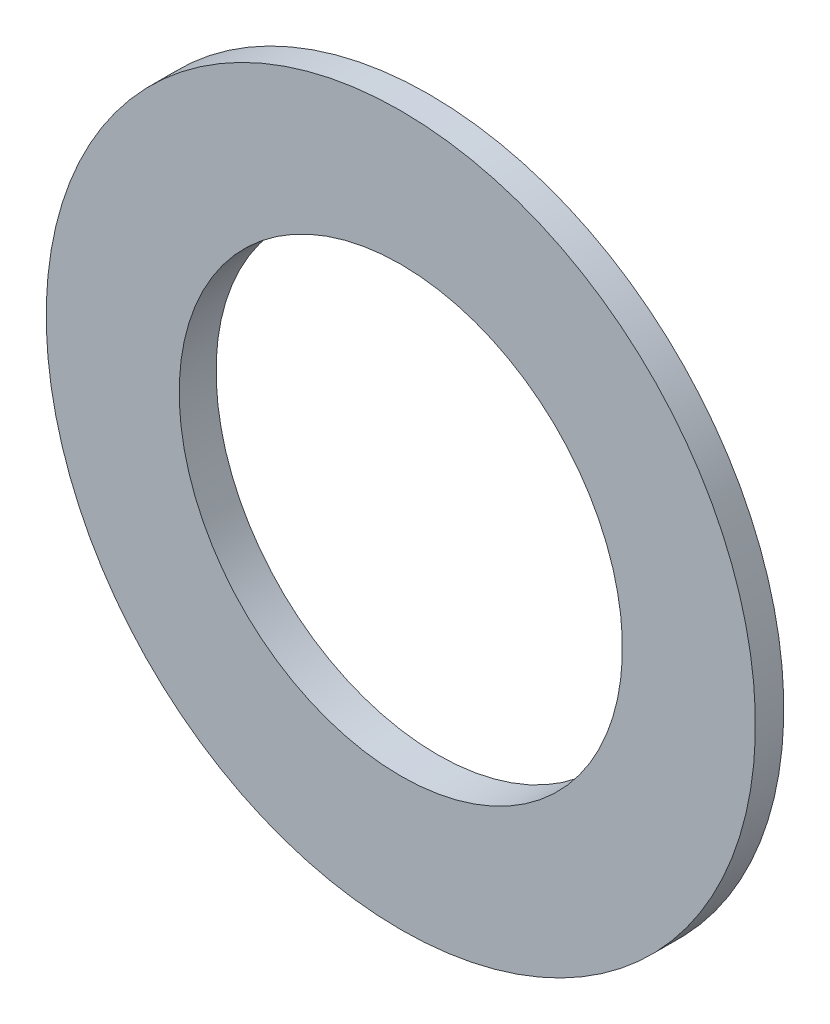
ISO-10303-21;
HEADER;
FILE_DESCRIPTION(('STEP AP214'),'2;1');
FILE_NAME('part.step','',(''),(''),'','','');
FILE_SCHEMA(('AUTOMOTIVE_DESIGN { 1 0 10303 214 1 1 1 1 }'));
ENDSEC;
DATA;
#1=APPLICATION_CONTEXT('core data for automotive mechanical design processes');
#2=APPLICATION_PROTOCOL_DEFINITION('international standard','automotive_design',2000,#1);
#3=PRODUCT_CONTEXT('',#1,'mechanical');
#4=PRODUCT('Part','Part','',(#3));
#5=PRODUCT_RELATED_PRODUCT_CATEGORY('part','',(#4));
#6=PRODUCT_DEFINITION_FORMATION('','',#4);
#7=PRODUCT_DEFINITION_CONTEXT('part definition',#1,'design');
#8=PRODUCT_DEFINITION('design','',#6,#7);
#9=PRODUCT_DEFINITION_SHAPE('','',#8);
#10=(LENGTH_UNIT() NAMED_UNIT(*) SI_UNIT(.MILLI.,.METRE.));
#11=(NAMED_UNIT(*) PLANE_ANGLE_UNIT() SI_UNIT($,.RADIAN.));
#12=(NAMED_UNIT(*) SI_UNIT($,.STERADIAN.) SOLID_ANGLE_UNIT());
#13=UNCERTAINTY_MEASURE_WITH_UNIT(LENGTH_MEASURE(1.E-05),#10,'distance_accuracy_value','');
#14=(GEOMETRIC_REPRESENTATION_CONTEXT(3) GLOBAL_UNCERTAINTY_ASSIGNED_CONTEXT((#13)) GLOBAL_UNIT_ASSIGNED_CONTEXT((#10,
#11,#12)) REPRESENTATION_CONTEXT('',''));
#15=CARTESIAN_POINT('',(0.,0.,0.));
#16=DIRECTION('',(0.,0.,1.));
#17=DIRECTION('',(1.,0.,0.));
#18=AXIS2_PLACEMENT_3D('',#15,#16,#17);
#19=CARTESIAN_POINT('',(0.,0.,201.93));
#20=DIRECTION('',(0.,0.,1.));
#21=DIRECTION('',(0.,1.,0.));
#22=AXIS2_PLACEMENT_3D('',#19,#20,#21);
#23=SPHERICAL_SURFACE('',#22,201.93);
#24=CARTESIAN_POINT('',(0.,0.,0.243872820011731));
#25=DIRECTION('',(0.,0.,1.));
#26=DIRECTION('',(1.,0.,0.));
#27=AXIS2_PLACEMENT_3D('',#24,#25,#26);
#28=CIRCLE('',#27,9.92124);
#29=CARTESIAN_POINT('',(0.,9.92123999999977,0.243872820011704));
#30=VERTEX_POINT('',#29);
#31=EDGE_CURVE('E10',#30,#30,#28,.T.);
#32=CARTESIAN_POINT('',(0.,0.,0.624984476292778));
#33=DIRECTION('',(0.,0.,1.));
#34=DIRECTION('',(1.,0.,0.));
#35=AXIS2_PLACEMENT_3D('',#32,#33,#34);
#36=CIRCLE('',#35,15.875);
#37=CARTESIAN_POINT('',(0.,15.8749999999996,0.62498447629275));
#38=VERTEX_POINT('',#37);
#39=EDGE_CURVE('E37',#38,#38,#36,.T.);
#40=CARTESIAN_POINT('',(0.,9.92123999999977,0.243872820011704));
#41=CARTESIAN_POINT('',(0.,9.9833124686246,0.246926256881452));
#42=CARTESIAN_POINT('',(0.,10.0453835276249,0.25000834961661));
#43=CARTESIAN_POINT('',(0.,10.1695227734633,0.256229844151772));
#44=CARTESIAN_POINT('',(0.,10.2315909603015,0.259369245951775));
#45=CARTESIAN_POINT('',(0.,10.3557244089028,0.265705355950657));
#46=CARTESIAN_POINT('',(0.,10.417789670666,0.268902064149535));
#47=CARTESIAN_POINT('',(0.,10.5419172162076,0.275352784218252));
#48=CARTESIAN_POINT('',(0.,10.603979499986,0.278606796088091));
#49=CARTESIAN_POINT('',(0.,10.7281010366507,0.285172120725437));
#50=CARTESIAN_POINT('',(0.,10.7901602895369,0.288483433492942));
#51=CARTESIAN_POINT('',(0.,10.9142757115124,0.295163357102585));
#52=CARTESIAN_POINT('',(0.,10.9763318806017,0.298531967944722));
#53=CARTESIAN_POINT('',(0.,11.1004410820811,0.305326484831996));
#54=CARTESIAN_POINT('',(0.,11.1624941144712,0.308752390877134));
#55=CARTESIAN_POINT('',(0.,11.2865969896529,0.315661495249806));
#56=CARTESIAN_POINT('',(0.,11.3486468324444,0.319144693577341));
#57=CARTESIAN_POINT('',(0.,11.4727432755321,0.32616837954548));
#58=CARTESIAN_POINT('',(0.,11.5347898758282,0.329708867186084));
#59=CARTESIAN_POINT('',(0.,11.6588797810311,0.336847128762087));
#60=CARTESIAN_POINT('',(0.,11.7209230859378,0.340444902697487));
#61=CARTESIAN_POINT('',(0.,11.8450063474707,0.34769773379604));
#62=CARTESIAN_POINT('',(0.,11.9070463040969,0.351352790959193));
#63=CARTESIAN_POINT('',(0.,12.0311228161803,0.358720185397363));
#64=CARTESIAN_POINT('',(0.,12.0931593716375,0.36243252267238));
#65=CARTESIAN_POINT('',(0.,12.2172290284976,0.369914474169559));
#66=CARTESIAN_POINT('',(0.,12.2792621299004,0.373684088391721));
#67=CARTESIAN_POINT('',(0.,12.4033248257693,0.381280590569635));
#68=CARTESIAN_POINT('',(0.,12.4653544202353,0.385107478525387));
#69=CARTESIAN_POINT('',(0.,12.5894100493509,0.392818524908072));
#70=CARTESIAN_POINT('',(0.,12.6514360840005,0.396702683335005));
#71=CARTESIAN_POINT('',(0.,12.7754845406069,0.404528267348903));
#72=CARTESIAN_POINT('',(0.,12.8375069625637,0.408469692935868));
#73=CARTESIAN_POINT('',(0.,12.961548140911,0.416409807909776));
#74=CARTESIAN_POINT('',(0.,13.0235668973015,0.420408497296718));
#75=CARTESIAN_POINT('',(0.,13.1476006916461,0.428463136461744));
#76=CARTESIAN_POINT('',(0.,13.2096157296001,0.432519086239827));
#77=CARTESIAN_POINT('',(0.,13.3336420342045,0.440688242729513));
#78=CARTESIAN_POINT('',(0.,13.3956533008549,0.444801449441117));
#79=CARTESIAN_POINT('',(0.,13.5196720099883,0.453085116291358));
#80=CARTESIAN_POINT('',(0.,13.5816794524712,0.457255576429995));
#81=CARTESIAN_POINT('',(0.,13.705690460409,0.46565374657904));
#82=CARTESIAN_POINT('',(0.,13.7676940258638,0.469881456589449));
#83=CARTESIAN_POINT('',(0.,13.891697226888,0.478394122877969));
#84=CARTESIAN_POINT('',(0.,13.9536968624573,0.482679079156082));
#85=CARTESIAN_POINT('',(0.,14.0776921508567,0.491306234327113));
#86=CARTESIAN_POINT('',(0.,14.1396878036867,0.495648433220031));
#87=CARTESIAN_POINT('',(0.,14.2636750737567,0.504390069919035));
#88=CARTESIAN_POINT('',(0.,14.3256666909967,0.50878950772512));
#89=CARTESIAN_POINT('',(0.,14.4496458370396,0.517645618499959));
#90=CARTESIAN_POINT('',(0.,14.5116333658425,0.522102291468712));
#91=CARTESIAN_POINT('',(0.,14.6356042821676,0.531072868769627));
#92=CARTESIAN_POINT('',(0.,14.6975876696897,0.535586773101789));
#93=CARTESIAN_POINT('',(0.,14.8215502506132,0.54467180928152));
#94=CARTESIAN_POINT('',(0.,14.8835294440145,0.54924294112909));
#95=CARTESIAN_POINT('',(0.,15.0074835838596,0.558442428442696));
#96=CARTESIAN_POINT('',(0.,15.0694585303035,0.563070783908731));
#97=CARTESIAN_POINT('',(0.,15.1934041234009,0.572384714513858));
#98=CARTESIAN_POINT('',(0.,15.2553747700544,0.577070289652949));
#99=CARTESIAN_POINT('',(0.,15.379311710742,0.58649865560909));
#100=CARTESIAN_POINT('',(0.,15.441278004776,0.59124144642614));
#101=CARTESIAN_POINT('',(0.,15.5652061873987,0.600784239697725));
#102=CARTESIAN_POINT('',(0.,15.6271680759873,0.60558424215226));
#103=CARTESIAN_POINT('',(0.,15.7510873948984,0.615241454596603));
#104=CARTESIAN_POINT('',(0.,15.8130448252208,0.620098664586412));
#105=CARTESIAN_POINT('',(0.,15.8749999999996,0.62498447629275));
#106=B_SPLINE_CURVE_WITH_KNOTS('',3,(#40,#41,#42,#43,#44,#45,#46,#47,#48,#49,#50,#51,#52,#53,
#54,#55,#56,#57,#58,#59,#60,#61,#62,#63,#64,#65,#66,#67,#68,#69,#70,#71,#72,#73,#74,#75,#76,#77,
#78,#79,#80,#81,#82,#83,#84,#85,#86,#87,#88,#89,#90,#91,#92,#93,#94,#95,#96,#97,#98,#99,#100,
#101,#102,#103,#104,#105),.UNSPECIFIED.,.F.,.F.,(4,2,2,2,2,2,2,2,2,2,2,2,2,2,2,2,2,2,2,2,2,2,2,
2,2,2,2,2,2,2,2,2,4),(0.,0.186442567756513,0.372885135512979,0.55932770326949,0.745770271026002,
0.932212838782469,1.11865540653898,1.30509797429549,1.491540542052,1.67798310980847,
1.86442567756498,2.05086824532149,2.23731081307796,2.42375338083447,2.61019594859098,
2.79663851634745,2.98308108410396,3.16952365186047,3.35596621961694,3.54240878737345,
3.72885135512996,3.91529392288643,4.10173649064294,4.28817905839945,4.47462162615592,
4.66106419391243,4.84750676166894,5.03394932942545,5.22039189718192,5.40683446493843,
5.59327703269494,5.77971960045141,5.96616216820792),.UNSPECIFIED.);
#107=EDGE_CURVE('BSEAM30',#30,#38,#106,.T.);
#108=ORIENTED_EDGE('',*,*,#31,.T.);
#109=ORIENTED_EDGE('',*,*,#39,.F.);
#110=ORIENTED_EDGE('',*,*,#107,.T.);
#111=ORIENTED_EDGE('',*,*,#107,.F.);
#112=EDGE_LOOP('',(#108,#110,#109,#111));
#113=FACE_BOUND('',#112,.T.);
#114=ADVANCED_FACE('F30',(#113),#23,.T.);
#115=CARTESIAN_POINT('',(0.,0.,3.175));
#116=DIRECTION('',(0.,0.,1.));
#117=DIRECTION('',(1.,0.,0.));
#118=AXIS2_PLACEMENT_3D('',#115,#116,#117);
#119=CYLINDRICAL_SURFACE('',#118,9.92124);
#120=CARTESIAN_POINT('',(0.,0.,1.89498447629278));
#121=DIRECTION('',(0.,0.,-1.));
#122=DIRECTION('',(0.,1.,0.));
#123=AXIS2_PLACEMENT_3D('',#120,#121,#122);
#124=CIRCLE('',#123,9.92124);
#125=CARTESIAN_POINT('',(0.,9.92124,1.89498447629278));
#126=VERTEX_POINT('',#125);
#127=EDGE_CURVE('E41',#126,#126,#124,.F.);
#128=ORIENTED_EDGE('',*,*,#127,.T.);
#129=EDGE_LOOP('',(#128));
#130=FACE_BOUND('',#129,.T.);
#131=ORIENTED_EDGE('',*,*,#31,.F.);
#132=EDGE_LOOP('',(#131));
#133=FACE_BOUND('',#132,.T.);
#134=ADVANCED_FACE('F56',(#130,#133),#119,.F.);
#135=CARTESIAN_POINT('',(0.,0.,0.243872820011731));
#136=DIRECTION('',(0.,0.,1.));
#137=DIRECTION('',(1.,0.,0.));
#138=AXIS2_PLACEMENT_3D('',#135,#136,#137);
#139=CYLINDRICAL_SURFACE('',#138,15.875);
#140=CARTESIAN_POINT('',(0.,0.,1.89498447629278));
#141=DIRECTION('',(0.,0.,-1.));
#142=DIRECTION('',(0.,1.,0.));
#143=AXIS2_PLACEMENT_3D('',#140,#141,#142);
#144=CIRCLE('',#143,15.875);
#145=CARTESIAN_POINT('',(0.,15.875,1.89498447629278));
#146=VERTEX_POINT('',#145);
#147=EDGE_CURVE('E33',#146,#146,#144,.F.);
#148=ORIENTED_EDGE('',*,*,#147,.F.);
#149=EDGE_LOOP('',(#148));
#150=FACE_BOUND('',#149,.T.);
#151=ORIENTED_EDGE('',*,*,#39,.T.);
#152=EDGE_LOOP('',(#151));
#153=FACE_BOUND('',#152,.T.);
#154=ADVANCED_FACE('F53',(#150,#153),#139,.T.);
#155=CARTESIAN_POINT('',(-25.4,18.4838669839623,1.89498447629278));
#156=DIRECTION('',(0.,0.,-1.));
#157=DIRECTION('',(0.,1.,0.));
#158=AXIS2_PLACEMENT_3D('',#155,#156,#157);
#159=PLANE('',#158);
#160=ORIENTED_EDGE('',*,*,#147,.T.);
#161=EDGE_LOOP('',(#160));
#162=FACE_BOUND('',#161,.T.);
#163=ORIENTED_EDGE('',*,*,#127,.F.);
#164=EDGE_LOOP('',(#163));
#165=FACE_BOUND('',#164,.T.);
#166=ADVANCED_FACE('F50',(#162,#165),#159,.F.);
#167=CLOSED_SHELL('',(#114,#134,#154,#166));
#168=MANIFOLD_SOLID_BREP('B2',#167);
#169=ADVANCED_BREP_SHAPE_REPRESENTATION('',(#18,#168),#14);
#170=SHAPE_DEFINITION_REPRESENTATION(#9,#169);
ENDSEC;
END-ISO-10303-21;
